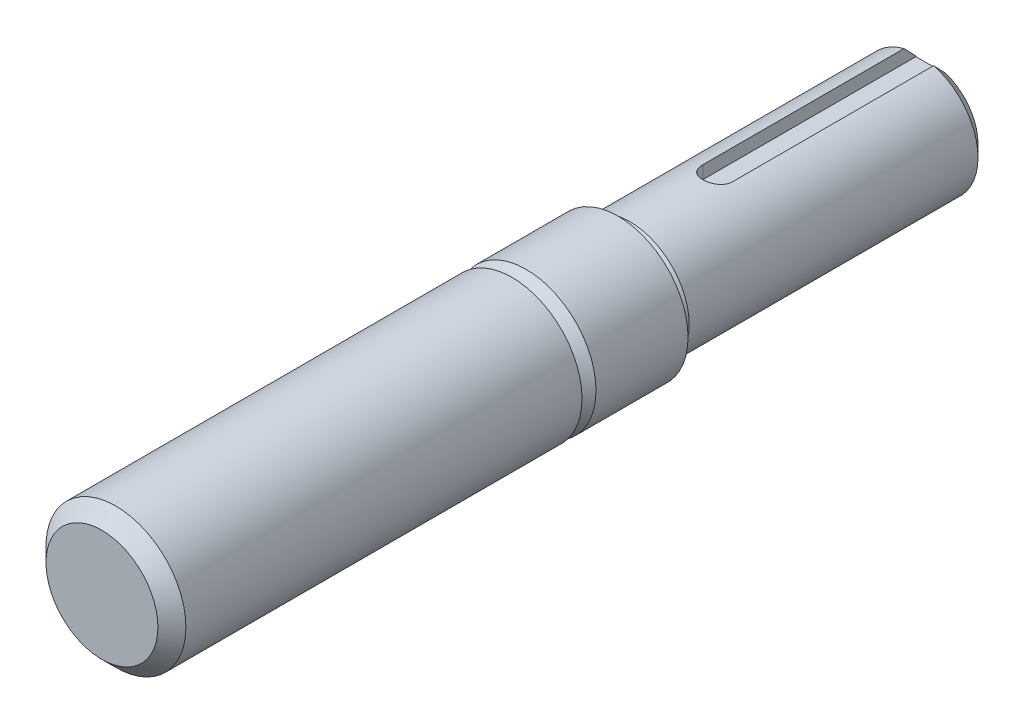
from build123d import *

# Parameters (mm, degrees)
F_123KEY_DEPTH = 91.055282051


with BuildPart() as part:
    # Sketch1 → Revolve1 (revolve)
    with BuildSketch(Plane(origin=(0, 0, 0), x_dir=(0, 0, -1), z_dir=(1, 0, 0)), mode=Mode.PRIVATE) as revolve1_sk:
        Polygon((0, 0), (0, 6.002528), (1.500632, 7.50316), (43.9928, 7.50316), (43.9928, 6.002528), (45.493432, 7.50316), (55.372, 7.50316), (55.372, 5.715), (56.642, 6.35), (87.63, 6.35), (88.9, 5.08), (88.9, 0), align=None)
    revolve(revolve1_sk.sketch.rotate(Axis((0, 0, 0), (0, 0, -1)), 90), axis=Axis((0, 0, 0), (0, 0, -1)))

    # Sketch4 → 123Key (cut, through all)
    with BuildSketch(Plane.XZ.offset(-4.7625)):
        with BuildLine():
            Line((1.590100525, -88.9), (1.590100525, -66.04))
            ThreePointArc((1.590100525, -66.04), (0.002600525, -64.4525), (-1.584899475, -66.04))
            Line((-1.584899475, -66.04), (-1.584899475, -88.9))
            Line((-1.584899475, -88.9), (1.590100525, -88.9))
        make_face()
    extrude(amount=-F_123KEY_DEPTH, mode=Mode.SUBTRACT)


solid = part.part
